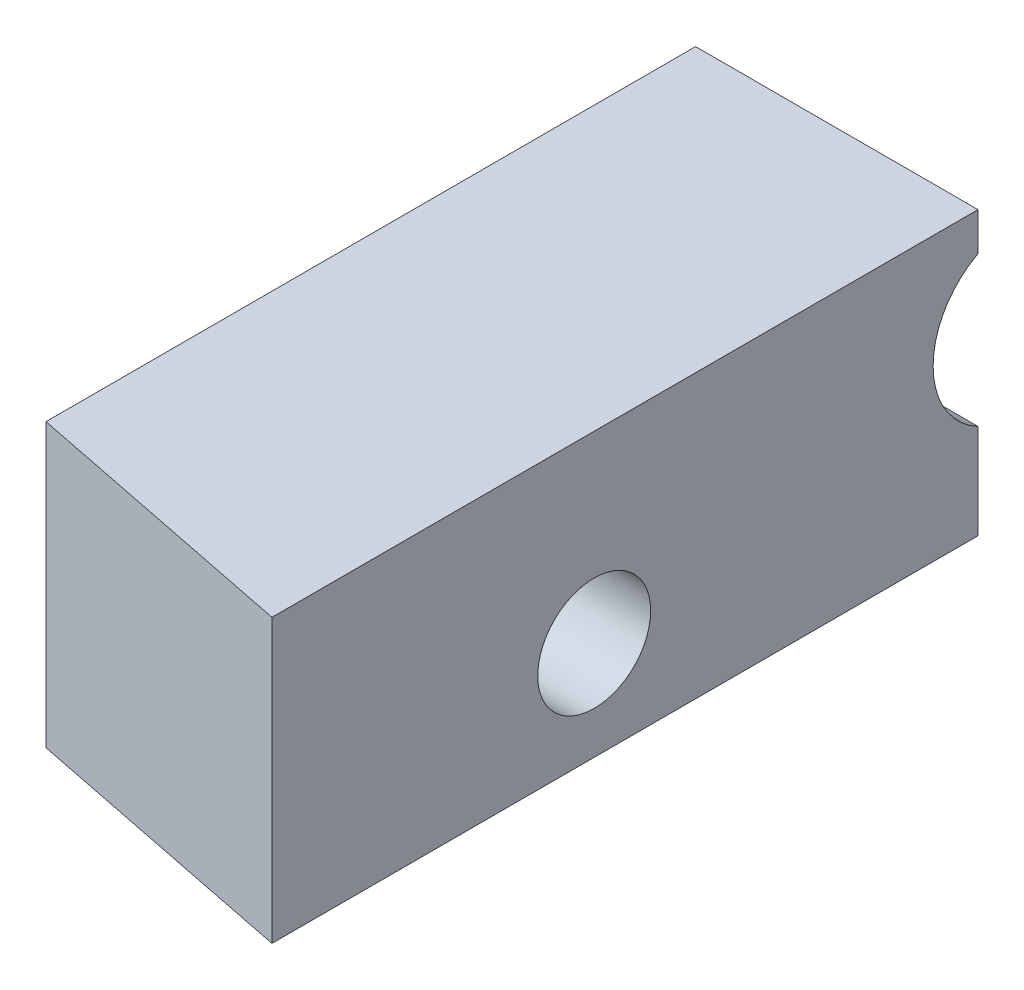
from build123d import *

# Parameters (mm, degrees)
ESQUISSE1_W             = 10
ESQUISSE1_H             = 10
EXTRUSION1_DEPTH        = 25
ENL_V_MAT_EXTRU_1_DEPTH = 29.722813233
ESQUISSE3_R             = 2
ENL_V_MAT_EXTRU_2_DEPTH = 29.722813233
ENL_V_MAT_EXTRU_4_DEPTH = 29.722813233


with BuildPart() as part:
    # Esquisse1 → Extrusion1 (new body)
    with BuildSketch(Plane.XY):
        with Locations((5, 5)):
            Rectangle(ESQUISSE1_W, ESQUISSE1_H)
    extrude(amount=EXTRUSION1_DEPTH)

    # Esquisse2 → Enl_v. mat.-Extru.1 (cut, through all)
    with BuildSketch(Plane(origin=(10, 0, 0), x_dir=(0, 0, -1), z_dir=(1, 0, 0))):
        with BuildLine():
            Line((1.410680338, 3), (1.410680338, 9))
            ThreePointArc((1.410680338, 9), (-1.589319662, 6), (1.410680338, 3))
        make_face()
    extrude(amount=-ENL_V_MAT_EXTRU_1_DEPTH, mode=Mode.SUBTRACT)

    # Esquisse3 → Enl_v. mat.-Extru.2 (cut, through all)
    with BuildSketch(Plane(origin=(10, 0, 0), x_dir=(0, 0, -1), z_dir=(1, 0, 0))):
        with Locations((-13.589319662, 3.5)):
            Circle(ESQUISSE3_R)
    extrude(amount=-ENL_V_MAT_EXTRU_2_DEPTH, mode=Mode.SUBTRACT)

    # Esquisse5 → Enl_v. mat.-Extru.4 (cut, through all)
    with BuildSketch(Plane.XZ):
        Polygon((10, 25), (0, 22.999987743), (-1.164650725, 26.615137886), (8.829288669, 26.615137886), align=None)
    extrude(amount=-ENL_V_MAT_EXTRU_4_DEPTH, mode=Mode.SUBTRACT)


solid = part.part
